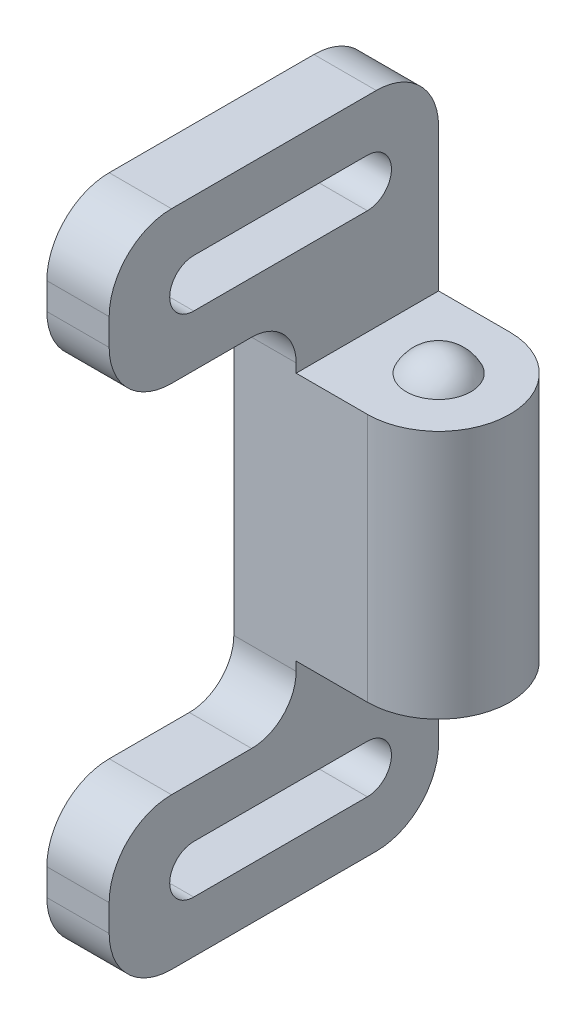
ISO-10303-21;
HEADER;
FILE_DESCRIPTION(('STEP AP214'),'2;1');
FILE_NAME('part.step','',(''),(''),'','','');
FILE_SCHEMA(('AUTOMOTIVE_DESIGN { 1 0 10303 214 1 1 1 1 }'));
ENDSEC;
DATA;
#1=APPLICATION_CONTEXT('core data for automotive mechanical design processes');
#2=APPLICATION_PROTOCOL_DEFINITION('international standard','automotive_design',2000,#1);
#3=PRODUCT_CONTEXT('',#1,'mechanical');
#4=PRODUCT('Part','Part','',(#3));
#5=PRODUCT_RELATED_PRODUCT_CATEGORY('part','',(#4));
#6=PRODUCT_DEFINITION_FORMATION('','',#4);
#7=PRODUCT_DEFINITION_CONTEXT('part definition',#1,'design');
#8=PRODUCT_DEFINITION('design','',#6,#7);
#9=PRODUCT_DEFINITION_SHAPE('','',#8);
#10=(LENGTH_UNIT() NAMED_UNIT(*) SI_UNIT(.MILLI.,.METRE.));
#11=(NAMED_UNIT(*) PLANE_ANGLE_UNIT() SI_UNIT($,.RADIAN.));
#12=(NAMED_UNIT(*) SI_UNIT($,.STERADIAN.) SOLID_ANGLE_UNIT());
#13=UNCERTAINTY_MEASURE_WITH_UNIT(LENGTH_MEASURE(1.E-05),#10,'distance_accuracy_value','');
#14=(GEOMETRIC_REPRESENTATION_CONTEXT(3) GLOBAL_UNCERTAINTY_ASSIGNED_CONTEXT((#13)) GLOBAL_UNIT_ASSIGNED_CONTEXT((#10,
#11,#12)) REPRESENTATION_CONTEXT('',''));
#15=CARTESIAN_POINT('',(0.,0.,0.));
#16=DIRECTION('',(0.,0.,1.));
#17=DIRECTION('',(1.,0.,0.));
#18=AXIS2_PLACEMENT_3D('',#15,#16,#17);
#19=CARTESIAN_POINT('',(15.,-12.3,0.));
#20=DIRECTION('',(1.,0.,0.));
#21=DIRECTION('',(0.,1.,0.));
#22=AXIS2_PLACEMENT_3D('',#19,#20,#21);
#23=SPHERICAL_SURFACE('',#22,3.99999999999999);
#24=CARTESIAN_POINT('',(18.6207733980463,-14.,0.));
#25=CARTESIAN_POINT('',(18.6207727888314,-14.,0.101659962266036));
#26=CARTESIAN_POINT('',(18.6164881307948,-14.,0.203338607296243));
#27=CARTESIAN_POINT('',(18.5993773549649,-14.,0.405993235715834));
#28=CARTESIAN_POINT('',(18.5865487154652,-14.,0.506969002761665));
#29=CARTESIAN_POINT('',(18.5524076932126,-14.,0.707650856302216));
#30=CARTESIAN_POINT('',(18.5310818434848,-14.,0.807354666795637));
#31=CARTESIAN_POINT('',(18.4800934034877,-14.,1.00466676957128));
#32=CARTESIAN_POINT('',(18.4504240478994,-14.,1.10227329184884));
#33=CARTESIAN_POINT('',(18.3493109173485,-14.,1.3904834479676));
#34=CARTESIAN_POINT('',(18.2656790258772,-14.,1.57696270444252));
#35=CARTESIAN_POINT('',(18.0682507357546,-14.,1.93321304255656));
#36=CARTESIAN_POINT('',(17.9544531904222,-14.,2.10298348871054));
#37=CARTESIAN_POINT('',(17.7637233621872,-14.,2.34141903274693));
#38=CARTESIAN_POINT('',(17.6967574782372,-14.,2.41823910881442));
#39=CARTESIAN_POINT('',(17.5566451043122,-14.,2.56591190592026));
#40=CARTESIAN_POINT('',(17.4835046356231,-14.,2.63677030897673));
#41=CARTESIAN_POINT('',(17.3314794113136,-14.,2.77210467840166));
#42=CARTESIAN_POINT('',(17.2525920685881,-14.,2.83657773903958));
#43=CARTESIAN_POINT('',(17.0896736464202,-14.,2.95865551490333));
#44=CARTESIAN_POINT('',(17.0056413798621,-14.,3.01625863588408));
#45=CARTESIAN_POINT('',(16.7467434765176,-14.,3.17808174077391));
#46=CARTESIAN_POINT('',(16.5649160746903,-14.,3.27145822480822));
#47=CARTESIAN_POINT('',(16.1882634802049,-14.,3.42630276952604));
#48=CARTESIAN_POINT('',(15.9934384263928,-14.,3.48777117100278));
#49=CARTESIAN_POINT('',(15.5962087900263,-14.,3.57714367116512));
#50=CARTESIAN_POINT('',(15.3938041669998,-14.,3.60504759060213));
#51=CARTESIAN_POINT('',(14.987183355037,-14.,3.62647012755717));
#52=CARTESIAN_POINT('',(14.7829671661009,-14.,3.61998874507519));
#53=CARTESIAN_POINT('',(14.3785455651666,-14.,3.57285068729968));
#54=CARTESIAN_POINT('',(14.1783401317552,-14.,3.53219419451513));
#55=CARTESIAN_POINT('',(13.7875020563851,-14.,3.41778436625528));
#56=CARTESIAN_POINT('',(13.5968695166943,-14.,3.34403067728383));
#57=CARTESIAN_POINT('',(13.322400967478,-14.,3.21030761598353));
#58=CARTESIAN_POINT('',(13.2327811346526,-14.,3.16185323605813));
#59=CARTESIAN_POINT('',(13.0579370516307,-14.,3.05757024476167));
#60=CARTESIAN_POINT('',(12.9727117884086,-14.,3.00174334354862));
#61=CARTESIAN_POINT('',(12.8073076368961,-14.,2.88313252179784));
#62=CARTESIAN_POINT('',(12.7271264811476,-14.,2.82035176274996));
#63=CARTESIAN_POINT('',(12.5722727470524,-14.,2.68821905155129));
#64=CARTESIAN_POINT('',(12.4976055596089,-14.,2.61886081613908));
#65=CARTESIAN_POINT('',(12.2828775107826,-14.,2.40178654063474));
#66=CARTESIAN_POINT('',(12.1518709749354,-14.,2.24491342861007));
#67=CARTESIAN_POINT('',(11.9181019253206,-14.,1.91138042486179));
#68=CARTESIAN_POINT('',(11.815338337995,-14.,1.7347212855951));
#69=CARTESIAN_POINT('',(11.6845007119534,-14.,1.45873129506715));
#70=CARTESIAN_POINT('',(11.6447394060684,-14.,1.36478267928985));
#71=CARTESIAN_POINT('',(11.5733002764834,-14.,1.17392058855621));
#72=CARTESIAN_POINT('',(11.5416159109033,-14.,1.07700958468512));
#73=CARTESIAN_POINT('',(11.4865768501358,-14.,0.881026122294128));
#74=CARTESIAN_POINT('',(11.4632090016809,-14.,0.781957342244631));
#75=CARTESIAN_POINT('',(11.4248986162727,-14.,0.582222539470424));
#76=CARTESIAN_POINT('',(11.4099535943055,-14.,0.481556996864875));
#77=CARTESIAN_POINT('',(11.3925947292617,-14.,0.317279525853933));
#78=CARTESIAN_POINT('',(11.3875832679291,-14.,0.253930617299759));
#79=CARTESIAN_POINT('',(11.3808990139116,-14.,0.127056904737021));
#80=CARTESIAN_POINT('',(11.3792262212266,-14.,0.0635321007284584));
#81=CARTESIAN_POINT('',(11.3792272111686,-14.,-0.101659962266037));
#82=CARTESIAN_POINT('',(11.3835118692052,-14.,-0.203338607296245));
#83=CARTESIAN_POINT('',(11.4006226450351,-14.,-0.405993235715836));
#84=CARTESIAN_POINT('',(11.4134512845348,-14.,-0.506969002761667));
#85=CARTESIAN_POINT('',(11.4475923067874,-14.,-0.707650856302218));
#86=CARTESIAN_POINT('',(11.4689181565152,-14.,-0.80735466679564));
#87=CARTESIAN_POINT('',(11.5199065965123,-14.,-1.00466676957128));
#88=CARTESIAN_POINT('',(11.5495759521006,-14.,-1.10227329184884));
#89=CARTESIAN_POINT('',(11.6506890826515,-14.,-1.3904834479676));
#90=CARTESIAN_POINT('',(11.7343209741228,-14.,-1.57696270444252));
#91=CARTESIAN_POINT('',(11.9317492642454,-14.,-1.93321304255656));
#92=CARTESIAN_POINT('',(12.0455468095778,-14.,-2.10298348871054));
#93=CARTESIAN_POINT('',(12.2362766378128,-14.,-2.34141903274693));
#94=CARTESIAN_POINT('',(12.3032425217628,-14.,-2.41823910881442));
#95=CARTESIAN_POINT('',(12.4433548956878,-14.,-2.56591190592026));
#96=CARTESIAN_POINT('',(12.5164953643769,-14.,-2.63677030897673));
#97=CARTESIAN_POINT('',(12.6685205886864,-14.,-2.77210467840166));
#98=CARTESIAN_POINT('',(12.7474079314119,-14.,-2.83657773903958));
#99=CARTESIAN_POINT('',(12.9103263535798,-14.,-2.95865551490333));
#100=CARTESIAN_POINT('',(12.9943586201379,-14.,-3.01625863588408));
#101=CARTESIAN_POINT('',(13.2532565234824,-14.,-3.17808174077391));
#102=CARTESIAN_POINT('',(13.4350839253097,-14.,-3.27145822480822));
#103=CARTESIAN_POINT('',(13.8117365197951,-14.,-3.42630276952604));
#104=CARTESIAN_POINT('',(14.0065615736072,-14.,-3.48777117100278));
#105=CARTESIAN_POINT('',(14.4037912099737,-14.,-3.57714367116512));
#106=CARTESIAN_POINT('',(14.6061958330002,-14.,-3.60504759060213));
#107=CARTESIAN_POINT('',(15.012816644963,-14.,-3.62647012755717));
#108=CARTESIAN_POINT('',(15.2170328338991,-14.,-3.61998874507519));
#109=CARTESIAN_POINT('',(15.6214544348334,-14.,-3.57285068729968));
#110=CARTESIAN_POINT('',(15.8216598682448,-14.,-3.53219419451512));
#111=CARTESIAN_POINT('',(16.2124979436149,-14.,-3.41778436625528));
#112=CARTESIAN_POINT('',(16.4031304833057,-14.,-3.34403067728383));
#113=CARTESIAN_POINT('',(16.677599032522,-14.,-3.21030761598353));
#114=CARTESIAN_POINT('',(16.7672188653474,-14.,-3.16185323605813));
#115=CARTESIAN_POINT('',(16.9420629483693,-14.,-3.05757024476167));
#116=CARTESIAN_POINT('',(17.0272882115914,-14.,-3.00174334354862));
#117=CARTESIAN_POINT('',(17.1926923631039,-14.,-2.88313252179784));
#118=CARTESIAN_POINT('',(17.2728735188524,-14.,-2.82035176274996));
#119=CARTESIAN_POINT('',(17.4277272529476,-14.,-2.68821905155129));
#120=CARTESIAN_POINT('',(17.5023944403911,-14.,-2.61886081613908));
#121=CARTESIAN_POINT('',(17.7171224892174,-14.,-2.40178654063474));
#122=CARTESIAN_POINT('',(17.8481290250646,-14.,-2.24491342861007));
#123=CARTESIAN_POINT('',(18.0818980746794,-14.,-1.91138042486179));
#124=CARTESIAN_POINT('',(18.184661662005,-14.,-1.7347212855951));
#125=CARTESIAN_POINT('',(18.3154992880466,-14.,-1.45873129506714));
#126=CARTESIAN_POINT('',(18.3552605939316,-14.,-1.36478267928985));
#127=CARTESIAN_POINT('',(18.4266997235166,-14.,-1.17392058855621));
#128=CARTESIAN_POINT('',(18.4583840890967,-14.,-1.07700958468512));
#129=CARTESIAN_POINT('',(18.5134231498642,-14.,-0.881026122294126));
#130=CARTESIAN_POINT('',(18.5367909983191,-14.,-0.781957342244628));
#131=CARTESIAN_POINT('',(18.5751013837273,-14.,-0.582222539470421));
#132=CARTESIAN_POINT('',(18.5900464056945,-14.,-0.481556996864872));
#133=CARTESIAN_POINT('',(18.6074052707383,-14.,-0.317279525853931));
#134=CARTESIAN_POINT('',(18.6124167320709,-14.,-0.253930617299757));
#135=CARTESIAN_POINT('',(18.6191009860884,-14.,-0.127056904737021));
#136=CARTESIAN_POINT('',(18.6207737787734,-14.,-0.0635321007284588));
#137=CARTESIAN_POINT('',(18.6207733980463,-14.,0.));
#138=B_SPLINE_CURVE_WITH_KNOTS('',3,(#24,#25,#26,#27,#28,#29,#30,#31,#32,#33,#34,#35,#36,#37,
#38,#39,#40,#41,#42,#43,#44,#45,#46,#47,#48,#49,#50,#51,#52,#53,#54,#55,#56,#57,#58,#59,#60,#61,
#62,#63,#64,#65,#66,#67,#68,#69,#70,#71,#72,#73,#74,#75,#76,#77,#78,#79,#80,#81,#82,#83,#84,#85,
#86,#87,#88,#89,#90,#91,#92,#93,#94,#95,#96,#97,#98,#99,#100,#101,#102,#103,#104,#105,#106,#107,
#108,#109,#110,#111,#112,#113,#114,#115,#116,#117,#118,#119,#120,#121,#122,#123,#124,#125,#126,
#127,#128,#129,#130,#131,#132,#133,#134,#135,#136,#137),.UNSPECIFIED.,.T.,.F.,(4,2,2,2,2,2,2,2,
2,2,2,2,2,2,2,2,2,2,2,2,2,2,2,2,2,2,2,2,2,2,2,2,2,2,2,2,2,2,2,2,2,2,2,2,2,2,2,2,2,2,2,2,2,2,2,2,
4),(0.,0.30492139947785,0.609932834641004,0.915429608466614,1.22117481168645,1.83120776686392,
2.44126391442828,2.74669168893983,3.0518249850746,3.35709650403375,3.66243872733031,
4.27248653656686,4.88252783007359,5.49257238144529,6.10261693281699,6.71265822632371,
7.32270603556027,7.62804825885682,7.93331977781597,8.23845307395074,8.54388084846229,
9.15393699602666,9.76396995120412,10.069715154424,10.3752119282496,10.6802233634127,
10.9851447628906,11.1757045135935,11.3662642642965,11.6711856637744,11.9761970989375,
12.2816938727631,12.587439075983,13.1974720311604,13.8075281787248,14.1129559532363,
14.4180892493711,14.7233607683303,15.0287029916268,15.6387508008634,16.2487920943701,
16.8588366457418,17.4688811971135,18.0789224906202,18.6889702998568,18.9943125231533,
19.2995840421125,19.6047173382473,19.9101451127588,20.5202012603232,21.1302342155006,
21.4359794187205,21.7414761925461,22.0464876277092,22.3514090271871,22.5419687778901,
22.732528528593),.UNSPECIFIED.);
#139=CARTESIAN_POINT('',(18.6207733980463,-14.,0.));
#140=VERTEX_POINT('',#139);
#141=EDGE_CURVE('E21',#140,#140,#138,.T.);
#142=ORIENTED_EDGE('',*,*,#141,.T.);
#143=EDGE_LOOP('',(#142));
#144=FACE_BOUND('',#143,.T.);
#145=ADVANCED_FACE('F16',(#144),#23,.T.);
#146=CARTESIAN_POINT('',(15.,12.3,0.));
#147=DIRECTION('',(1.,0.,0.));
#148=DIRECTION('',(0.,1.,0.));
#149=AXIS2_PLACEMENT_3D('',#146,#147,#148);
#150=SPHERICAL_SURFACE('',#149,3.99999999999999);
#151=CARTESIAN_POINT('',(18.6207733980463,14.,0.));
#152=CARTESIAN_POINT('',(18.6207727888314,14.,0.101659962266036));
#153=CARTESIAN_POINT('',(18.6164881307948,14.,0.203338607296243));
#154=CARTESIAN_POINT('',(18.5993773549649,14.,0.405993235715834));
#155=CARTESIAN_POINT('',(18.5865487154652,14.,0.506969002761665));
#156=CARTESIAN_POINT('',(18.5524076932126,14.,0.707650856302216));
#157=CARTESIAN_POINT('',(18.5310818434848,14.,0.807354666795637));
#158=CARTESIAN_POINT('',(18.4800934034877,14.,1.00466676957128));
#159=CARTESIAN_POINT('',(18.4504240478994,14.,1.10227329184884));
#160=CARTESIAN_POINT('',(18.3493109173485,14.,1.3904834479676));
#161=CARTESIAN_POINT('',(18.2656790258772,14.,1.57696270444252));
#162=CARTESIAN_POINT('',(18.0682507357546,14.,1.93321304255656));
#163=CARTESIAN_POINT('',(17.9544531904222,14.,2.10298348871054));
#164=CARTESIAN_POINT('',(17.7637233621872,14.,2.34141903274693));
#165=CARTESIAN_POINT('',(17.6967574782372,14.,2.41823910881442));
#166=CARTESIAN_POINT('',(17.5566451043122,14.,2.56591190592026));
#167=CARTESIAN_POINT('',(17.4835046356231,14.,2.63677030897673));
#168=CARTESIAN_POINT('',(17.3314794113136,14.,2.77210467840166));
#169=CARTESIAN_POINT('',(17.2525920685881,14.,2.83657773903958));
#170=CARTESIAN_POINT('',(17.0896736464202,14.,2.95865551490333));
#171=CARTESIAN_POINT('',(17.0056413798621,14.,3.01625863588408));
#172=CARTESIAN_POINT('',(16.7467434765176,14.,3.17808174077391));
#173=CARTESIAN_POINT('',(16.5649160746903,14.,3.27145822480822));
#174=CARTESIAN_POINT('',(16.1882634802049,14.,3.42630276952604));
#175=CARTESIAN_POINT('',(15.9934384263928,14.,3.48777117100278));
#176=CARTESIAN_POINT('',(15.5962087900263,14.,3.57714367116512));
#177=CARTESIAN_POINT('',(15.3938041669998,14.,3.60504759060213));
#178=CARTESIAN_POINT('',(14.987183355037,14.,3.62647012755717));
#179=CARTESIAN_POINT('',(14.7829671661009,14.,3.61998874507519));
#180=CARTESIAN_POINT('',(14.3785455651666,14.,3.57285068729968));
#181=CARTESIAN_POINT('',(14.1783401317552,14.,3.53219419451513));
#182=CARTESIAN_POINT('',(13.7875020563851,14.,3.41778436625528));
#183=CARTESIAN_POINT('',(13.5968695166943,14.,3.34403067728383));
#184=CARTESIAN_POINT('',(13.322400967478,14.,3.21030761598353));
#185=CARTESIAN_POINT('',(13.2327811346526,14.,3.16185323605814));
#186=CARTESIAN_POINT('',(13.0579370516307,14.,3.05757024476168));
#187=CARTESIAN_POINT('',(12.9727117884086,14.,3.00174334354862));
#188=CARTESIAN_POINT('',(12.8073076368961,14.,2.88313252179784));
#189=CARTESIAN_POINT('',(12.7271264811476,14.,2.82035176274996));
#190=CARTESIAN_POINT('',(12.5722727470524,14.,2.68821905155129));
#191=CARTESIAN_POINT('',(12.4976055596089,14.,2.61886081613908));
#192=CARTESIAN_POINT('',(12.2828775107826,14.,2.40178654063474));
#193=CARTESIAN_POINT('',(12.1518709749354,14.,2.24491342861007));
#194=CARTESIAN_POINT('',(11.9181019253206,14.,1.91138042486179));
#195=CARTESIAN_POINT('',(11.815338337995,14.,1.7347212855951));
#196=CARTESIAN_POINT('',(11.6845007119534,14.,1.45873129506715));
#197=CARTESIAN_POINT('',(11.6447394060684,14.,1.36478267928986));
#198=CARTESIAN_POINT('',(11.5733002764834,14.,1.17392058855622));
#199=CARTESIAN_POINT('',(11.5416159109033,14.,1.07700958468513));
#200=CARTESIAN_POINT('',(11.4865768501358,14.,0.881026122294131));
#201=CARTESIAN_POINT('',(11.4632090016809,14.,0.781957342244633));
#202=CARTESIAN_POINT('',(11.4248986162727,14.,0.582222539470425));
#203=CARTESIAN_POINT('',(11.4099535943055,14.,0.481556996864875));
#204=CARTESIAN_POINT('',(11.3925947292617,14.,0.317279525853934));
#205=CARTESIAN_POINT('',(11.3875832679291,14.,0.253930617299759));
#206=CARTESIAN_POINT('',(11.3808990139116,14.,0.127056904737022));
#207=CARTESIAN_POINT('',(11.3792262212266,14.,0.0635321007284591));
#208=CARTESIAN_POINT('',(11.3792272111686,14.,-0.101659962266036));
#209=CARTESIAN_POINT('',(11.3835118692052,14.,-0.203338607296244));
#210=CARTESIAN_POINT('',(11.4006226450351,14.,-0.405993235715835));
#211=CARTESIAN_POINT('',(11.4134512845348,14.,-0.506969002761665));
#212=CARTESIAN_POINT('',(11.4475923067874,14.,-0.707650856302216));
#213=CARTESIAN_POINT('',(11.4689181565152,14.,-0.807354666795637));
#214=CARTESIAN_POINT('',(11.5199065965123,14.,-1.00466676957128));
#215=CARTESIAN_POINT('',(11.5495759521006,14.,-1.10227329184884));
#216=CARTESIAN_POINT('',(11.6506890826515,14.,-1.3904834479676));
#217=CARTESIAN_POINT('',(11.7343209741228,14.,-1.57696270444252));
#218=CARTESIAN_POINT('',(11.9317492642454,14.,-1.93321304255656));
#219=CARTESIAN_POINT('',(12.0455468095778,14.,-2.10298348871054));
#220=CARTESIAN_POINT('',(12.2362766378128,14.,-2.34141903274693));
#221=CARTESIAN_POINT('',(12.3032425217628,14.,-2.41823910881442));
#222=CARTESIAN_POINT('',(12.4433548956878,14.,-2.56591190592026));
#223=CARTESIAN_POINT('',(12.5164953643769,14.,-2.63677030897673));
#224=CARTESIAN_POINT('',(12.6685205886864,14.,-2.77210467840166));
#225=CARTESIAN_POINT('',(12.7474079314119,14.,-2.83657773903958));
#226=CARTESIAN_POINT('',(12.9103263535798,14.,-2.95865551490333));
#227=CARTESIAN_POINT('',(12.9943586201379,14.,-3.01625863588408));
#228=CARTESIAN_POINT('',(13.2532565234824,14.,-3.17808174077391));
#229=CARTESIAN_POINT('',(13.4350839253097,14.,-3.27145822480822));
#230=CARTESIAN_POINT('',(13.8117365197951,14.,-3.42630276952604));
#231=CARTESIAN_POINT('',(14.0065615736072,14.,-3.48777117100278));
#232=CARTESIAN_POINT('',(14.4037912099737,14.,-3.57714367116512));
#233=CARTESIAN_POINT('',(14.6061958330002,14.,-3.60504759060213));
#234=CARTESIAN_POINT('',(15.012816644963,14.,-3.62647012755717));
#235=CARTESIAN_POINT('',(15.2170328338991,14.,-3.61998874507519));
#236=CARTESIAN_POINT('',(15.6214544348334,14.,-3.57285068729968));
#237=CARTESIAN_POINT('',(15.8216598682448,14.,-3.53219419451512));
#238=CARTESIAN_POINT('',(16.2124979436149,14.,-3.41778436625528));
#239=CARTESIAN_POINT('',(16.4031304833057,14.,-3.34403067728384));
#240=CARTESIAN_POINT('',(16.677599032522,14.,-3.21030761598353));
#241=CARTESIAN_POINT('',(16.7672188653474,14.,-3.16185323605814));
#242=CARTESIAN_POINT('',(16.9420629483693,14.,-3.05757024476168));
#243=CARTESIAN_POINT('',(17.0272882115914,14.,-3.00174334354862));
#244=CARTESIAN_POINT('',(17.1926923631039,14.,-2.88313252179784));
#245=CARTESIAN_POINT('',(17.2728735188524,14.,-2.82035176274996));
#246=CARTESIAN_POINT('',(17.4277272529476,14.,-2.6882190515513));
#247=CARTESIAN_POINT('',(17.5023944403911,14.,-2.61886081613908));
#248=CARTESIAN_POINT('',(17.7171224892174,14.,-2.40178654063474));
#249=CARTESIAN_POINT('',(17.8481290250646,14.,-2.24491342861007));
#250=CARTESIAN_POINT('',(18.0818980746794,14.,-1.91138042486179));
#251=CARTESIAN_POINT('',(18.184661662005,14.,-1.7347212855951));
#252=CARTESIAN_POINT('',(18.3154992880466,14.,-1.45873129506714));
#253=CARTESIAN_POINT('',(18.3552605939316,14.,-1.36478267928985));
#254=CARTESIAN_POINT('',(18.4266997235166,14.,-1.17392058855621));
#255=CARTESIAN_POINT('',(18.4583840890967,14.,-1.07700958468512));
#256=CARTESIAN_POINT('',(18.5134231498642,14.,-0.881026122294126));
#257=CARTESIAN_POINT('',(18.5367909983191,14.,-0.781957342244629));
#258=CARTESIAN_POINT('',(18.5751013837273,14.,-0.582222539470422));
#259=CARTESIAN_POINT('',(18.5900464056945,14.,-0.481556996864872));
#260=CARTESIAN_POINT('',(18.6074052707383,14.,-0.317279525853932));
#261=CARTESIAN_POINT('',(18.6124167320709,14.,-0.253930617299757));
#262=CARTESIAN_POINT('',(18.6191009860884,14.,-0.127056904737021));
#263=CARTESIAN_POINT('',(18.6207737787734,14.,-0.0635321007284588));
#264=CARTESIAN_POINT('',(18.6207733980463,14.,0.));
#265=B_SPLINE_CURVE_WITH_KNOTS('',3,(#151,#152,#153,#154,#155,#156,#157,#158,#159,#160,#161,
#162,#163,#164,#165,#166,#167,#168,#169,#170,#171,#172,#173,#174,#175,#176,#177,#178,#179,#180,
#181,#182,#183,#184,#185,#186,#187,#188,#189,#190,#191,#192,#193,#194,#195,#196,#197,#198,#199,
#200,#201,#202,#203,#204,#205,#206,#207,#208,#209,#210,#211,#212,#213,#214,#215,#216,#217,#218,
#219,#220,#221,#222,#223,#224,#225,#226,#227,#228,#229,#230,#231,#232,#233,#234,#235,#236,#237,
#238,#239,#240,#241,#242,#243,#244,#245,#246,#247,#248,#249,#250,#251,#252,#253,#254,#255,#256,
#257,#258,#259,#260,#261,#262,#263,#264),.UNSPECIFIED.,.T.,.F.,(4,2,2,2,2,2,2,2,2,2,2,2,2,2,2,2,
2,2,2,2,2,2,2,2,2,2,2,2,2,2,2,2,2,2,2,2,2,2,2,2,2,2,2,2,2,2,2,2,2,2,2,2,2,2,2,2,4),(0.,
0.30492139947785,0.609932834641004,0.915429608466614,1.22117481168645,1.83120776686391,
2.44126391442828,2.74669168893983,3.0518249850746,3.35709650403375,3.66243872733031,
4.27248653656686,4.88252783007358,5.49257238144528,6.10261693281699,6.71265822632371,
7.32270603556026,7.62804825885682,7.93331977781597,8.23845307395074,8.54388084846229,
9.15393699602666,9.76396995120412,10.069715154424,10.3752119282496,10.6802233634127,
10.9851447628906,11.1757045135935,11.3662642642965,11.6711856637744,11.9761970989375,
12.2816938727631,12.587439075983,13.1974720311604,13.8075281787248,14.1129559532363,
14.4180892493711,14.7233607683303,15.0287029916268,15.6387508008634,16.2487920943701,
16.8588366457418,17.4688811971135,18.0789224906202,18.6889702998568,18.9943125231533,
19.2995840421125,19.6047173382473,19.9101451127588,20.5202012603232,21.1302342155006,
21.4359794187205,21.7414761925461,22.0464876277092,22.3514090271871,22.5419687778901,
22.732528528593),.UNSPECIFIED.);
#266=CARTESIAN_POINT('',(18.6207733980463,14.,0.));
#267=VERTEX_POINT('',#266);
#268=EDGE_CURVE('E263',#267,#267,#265,.T.);
#269=ORIENTED_EDGE('',*,*,#268,.F.);
#270=EDGE_LOOP('',(#269));
#271=FACE_BOUND('',#270,.T.);
#272=ADVANCED_FACE('F362',(#271),#150,.T.);
#273=CARTESIAN_POINT('',(0.,-14.,0.));
#274=DIRECTION('',(0.,1.,0.));
#275=DIRECTION('',(0.,0.,1.));
#276=AXIS2_PLACEMENT_3D('',#273,#274,#275);
#277=PLANE('',#276);
#278=ORIENTED_EDGE('',*,*,#141,.F.);
#279=EDGE_LOOP('',(#278));
#280=FACE_BOUND('',#279,.T.);
#281=DIRECTION('',(-1.,0.,0.));
#282=VECTOR('',#281,1.);
#283=CARTESIAN_POINT('',(0.,-14.,-8.));
#284=LINE('',#283,#282);
#285=CARTESIAN_POINT('',(15.,-14.,-8.));
#286=VERTEX_POINT('',#285);
#287=CARTESIAN_POINT('',(7.,-14.,-8.));
#288=VERTEX_POINT('',#287);
#289=EDGE_CURVE('E330',#286,#288,#284,.T.);
#290=ORIENTED_EDGE('',*,*,#289,.F.);
#291=CARTESIAN_POINT('',(15.,-14.,0.));
#292=DIRECTION('',(0.,1.,0.));
#293=DIRECTION('',(0.,0.,1.));
#294=AXIS2_PLACEMENT_3D('',#291,#292,#293);
#295=CIRCLE('',#294,8.);
#296=CARTESIAN_POINT('',(15.,-14.,8.));
#297=VERTEX_POINT('',#296);
#298=EDGE_CURVE('E741',#297,#286,#295,.T.);
#299=ORIENTED_EDGE('',*,*,#298,.F.);
#300=DIRECTION('',(1.,0.,0.));
#301=VECTOR('',#300,1.);
#302=CARTESIAN_POINT('',(0.,-14.,8.));
#303=LINE('',#302,#301);
#304=CARTESIAN_POINT('',(7.,-14.,8.));
#305=VERTEX_POINT('',#304);
#306=EDGE_CURVE('E233',#305,#297,#303,.T.);
#307=ORIENTED_EDGE('',*,*,#306,.F.);
#308=DIRECTION('',(0.,0.,-1.));
#309=VECTOR('',#308,1.);
#310=CARTESIAN_POINT('',(7.,-14.,0.));
#311=LINE('',#310,#309);
#312=EDGE_CURVE('E242',#288,#305,#311,.F.);
#313=ORIENTED_EDGE('',*,*,#312,.F.);
#314=EDGE_LOOP('',(#290,#299,#307,#313));
#315=FACE_BOUND('',#314,.T.);
#316=ADVANCED_FACE('F365',(#280,#315),#277,.F.);
#317=CARTESIAN_POINT('',(15.,14.,0.));
#318=DIRECTION('',(0.,1.,0.));
#319=DIRECTION('',(0.,0.,1.));
#320=AXIS2_PLACEMENT_3D('',#317,#318,#319);
#321=CYLINDRICAL_SURFACE('',#320,8.);
#322=CARTESIAN_POINT('',(15.,14.,0.));
#323=DIRECTION('',(0.,1.,0.));
#324=DIRECTION('',(0.,0.,1.));
#325=AXIS2_PLACEMENT_3D('',#322,#323,#324);
#326=CIRCLE('',#325,8.);
#327=CARTESIAN_POINT('',(15.,14.,8.));
#328=VERTEX_POINT('',#327);
#329=CARTESIAN_POINT('',(15.,14.,-8.));
#330=VERTEX_POINT('',#329);
#331=EDGE_CURVE('E376',#328,#330,#326,.T.);
#332=ORIENTED_EDGE('',*,*,#331,.F.);
#333=DIRECTION('',(0.,1.,0.));
#334=VECTOR('',#333,1.);
#335=CARTESIAN_POINT('',(15.,-15.,8.));
#336=LINE('',#335,#334);
#337=EDGE_CURVE('E269',#297,#328,#336,.T.);
#338=ORIENTED_EDGE('',*,*,#337,.F.);
#339=ORIENTED_EDGE('',*,*,#298,.T.);
#340=DIRECTION('',(0.,1.,0.));
#341=VECTOR('',#340,1.);
#342=CARTESIAN_POINT('',(15.,30.,-8.));
#343=LINE('',#342,#341);
#344=EDGE_CURVE('E326',#330,#286,#343,.F.);
#345=ORIENTED_EDGE('',*,*,#344,.F.);
#346=EDGE_LOOP('',(#332,#338,#339,#345));
#347=FACE_BOUND('',#346,.T.);
#348=ADVANCED_FACE('F381',(#347),#321,.T.);
#349=CARTESIAN_POINT('',(0.,14.,0.));
#350=DIRECTION('',(0.,1.,0.));
#351=DIRECTION('',(0.,0.,1.));
#352=AXIS2_PLACEMENT_3D('',#349,#350,#351);
#353=PLANE('',#352);
#354=ORIENTED_EDGE('',*,*,#268,.T.);
#355=EDGE_LOOP('',(#354));
#356=FACE_BOUND('',#355,.T.);
#357=ORIENTED_EDGE('',*,*,#331,.T.);
#358=DIRECTION('',(-1.,0.,0.));
#359=VECTOR('',#358,1.);
#360=CARTESIAN_POINT('',(0.,14.,-8.));
#361=LINE('',#360,#359);
#362=CARTESIAN_POINT('',(7.,14.,-8.));
#363=VERTEX_POINT('',#362);
#364=EDGE_CURVE('E257',#363,#330,#361,.F.);
#365=ORIENTED_EDGE('',*,*,#364,.F.);
#366=DIRECTION('',(0.,0.,-1.));
#367=VECTOR('',#366,1.);
#368=CARTESIAN_POINT('',(7.,14.,0.));
#369=LINE('',#368,#367);
#370=CARTESIAN_POINT('',(7.,14.,8.));
#371=VERTEX_POINT('',#370);
#372=EDGE_CURVE('E252',#371,#363,#369,.T.);
#373=ORIENTED_EDGE('',*,*,#372,.F.);
#374=DIRECTION('',(1.,0.,0.));
#375=VECTOR('',#374,1.);
#376=CARTESIAN_POINT('',(0.,14.,8.));
#377=LINE('',#376,#375);
#378=EDGE_CURVE('E255',#328,#371,#377,.F.);
#379=ORIENTED_EDGE('',*,*,#378,.F.);
#380=EDGE_LOOP('',(#357,#365,#373,#379));
#381=FACE_BOUND('',#380,.T.);
#382=ADVANCED_FACE('F254',(#356,#381),#353,.T.);
#383=CARTESIAN_POINT('',(7.,0.,0.));
#384=DIRECTION('',(1.,0.,0.));
#385=DIRECTION('',(0.,0.,-1.));
#386=AXIS2_PLACEMENT_3D('',#383,#384,#385);
#387=PLANE('',#386);
#388=CARTESIAN_POINT('',(7.,28.5,0.));
#389=DIRECTION('',(-1.,0.,0.));
#390=DIRECTION('',(0.,0.,1.));
#391=AXIS2_PLACEMENT_3D('',#388,#389,#390);
#392=CIRCLE('',#391,2.7);
#393=CARTESIAN_POINT('',(7.,31.2,0.));
#394=VERTEX_POINT('',#393);
#395=CARTESIAN_POINT('',(7.,25.8,0.));
#396=VERTEX_POINT('',#395);
#397=EDGE_CURVE('E271',#394,#396,#392,.T.);
#398=ORIENTED_EDGE('',*,*,#397,.T.);
#399=DIRECTION('',(0.,0.,1.));
#400=VECTOR('',#399,1.);
#401=CARTESIAN_POINT('',(7.,25.8,19.5));
#402=LINE('',#401,#400);
#403=CARTESIAN_POINT('',(7.,25.8,19.5));
#404=VERTEX_POINT('',#403);
#405=EDGE_CURVE('E548',#404,#396,#402,.F.);
#406=ORIENTED_EDGE('',*,*,#405,.F.);
#407=CARTESIAN_POINT('',(7.,28.5,19.5));
#408=DIRECTION('',(-1.,0.,0.));
#409=DIRECTION('',(0.,0.,1.));
#410=AXIS2_PLACEMENT_3D('',#407,#408,#409);
#411=CIRCLE('',#410,2.7);
#412=CARTESIAN_POINT('',(7.,31.2,19.5));
#413=VERTEX_POINT('',#412);
#414=EDGE_CURVE('E547',#404,#413,#411,.T.);
#415=ORIENTED_EDGE('',*,*,#414,.T.);
#416=DIRECTION('',(0.,0.,-1.));
#417=VECTOR('',#416,1.);
#418=CARTESIAN_POINT('',(7.,31.2,0.));
#419=LINE('',#418,#417);
#420=EDGE_CURVE('E543',#394,#413,#419,.F.);
#421=ORIENTED_EDGE('',*,*,#420,.F.);
#422=EDGE_LOOP('',(#398,#406,#415,#421));
#423=FACE_BOUND('',#422,.T.);
#424=CARTESIAN_POINT('',(7.,15.,13.));
#425=DIRECTION('',(-1.,0.,0.));
#426=DIRECTION('',(0.,0.,1.));
#427=AXIS2_PLACEMENT_3D('',#424,#425,#426);
#428=CIRCLE('',#427,5.);
#429=CARTESIAN_POINT('',(7.,20.,13.));
#430=VERTEX_POINT('',#429);
#431=CARTESIAN_POINT('',(7.,15.,8.));
#432=VERTEX_POINT('',#431);
#433=EDGE_CURVE('E275',#430,#432,#428,.T.);
#434=ORIENTED_EDGE('',*,*,#433,.T.);
#435=DIRECTION('',(0.,1.,0.));
#436=VECTOR('',#435,1.);
#437=CARTESIAN_POINT('',(7.,-15.,8.));
#438=LINE('',#437,#436);
#439=EDGE_CURVE('E266',#371,#432,#438,.T.);
#440=ORIENTED_EDGE('',*,*,#439,.F.);
#441=ORIENTED_EDGE('',*,*,#372,.T.);
#442=DIRECTION('',(0.,1.,0.));
#443=VECTOR('',#442,1.);
#444=CARTESIAN_POINT('',(7.,30.,-8.));
#445=LINE('',#444,#443);
#446=CARTESIAN_POINT('',(7.,30.,-8.));
#447=VERTEX_POINT('',#446);
#448=EDGE_CURVE('E320',#447,#363,#445,.F.);
#449=ORIENTED_EDGE('',*,*,#448,.F.);
#450=CARTESIAN_POINT('',(7.,30.,-0.999999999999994));
#451=DIRECTION('',(-1.,0.,0.));
#452=DIRECTION('',(0.,0.,1.));
#453=AXIS2_PLACEMENT_3D('',#450,#451,#452);
#454=CIRCLE('',#453,7.00000000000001);
#455=CARTESIAN_POINT('',(7.,37.,-0.999999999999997));
#456=VERTEX_POINT('',#455);
#457=EDGE_CURVE('E334',#456,#447,#454,.T.);
#458=ORIENTED_EDGE('',*,*,#457,.F.);
#459=DIRECTION('',(0.,0.,1.));
#460=VECTOR('',#459,1.);
#461=CARTESIAN_POINT('',(7.,37.,22.));
#462=LINE('',#461,#460);
#463=CARTESIAN_POINT('',(7.,37.,22.));
#464=VERTEX_POINT('',#463);
#465=EDGE_CURVE('E315',#464,#456,#462,.F.);
#466=ORIENTED_EDGE('',*,*,#465,.F.);
#467=CARTESIAN_POINT('',(7.,30.,22.));
#468=DIRECTION('',(-1.,0.,0.));
#469=DIRECTION('',(0.,0.,1.));
#470=AXIS2_PLACEMENT_3D('',#467,#468,#469);
#471=CIRCLE('',#470,7.00000000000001);
#472=CARTESIAN_POINT('',(7.,30.,29.));
#473=VERTEX_POINT('',#472);
#474=EDGE_CURVE('E599',#473,#464,#471,.T.);
#475=ORIENTED_EDGE('',*,*,#474,.F.);
#476=DIRECTION('',(0.,1.,0.));
#477=VECTOR('',#476,1.);
#478=CARTESIAN_POINT('',(7.,27.,29.));
#479=LINE('',#478,#477);
#480=CARTESIAN_POINT('',(7.,27.,29.));
#481=VERTEX_POINT('',#480);
#482=EDGE_CURVE('E310',#481,#473,#479,.T.);
#483=ORIENTED_EDGE('',*,*,#482,.F.);
#484=CARTESIAN_POINT('',(7.,27.,22.));
#485=DIRECTION('',(-1.,0.,0.));
#486=DIRECTION('',(0.,0.,1.));
#487=AXIS2_PLACEMENT_3D('',#484,#485,#486);
#488=CIRCLE('',#487,7.00000000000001);
#489=CARTESIAN_POINT('',(7.,20.,22.));
#490=VERTEX_POINT('',#489);
#491=EDGE_CURVE('E596',#490,#481,#488,.T.);
#492=ORIENTED_EDGE('',*,*,#491,.F.);
#493=DIRECTION('',(0.,0.,-1.));
#494=VECTOR('',#493,1.);
#495=CARTESIAN_POINT('',(7.,20.,13.));
#496=LINE('',#495,#494);
#497=EDGE_CURVE('E305',#430,#490,#496,.F.);
#498=ORIENTED_EDGE('',*,*,#497,.F.);
#499=EDGE_LOOP('',(#434,#440,#441,#449,#458,#466,#475,#483,#492,#498));
#500=FACE_BOUND('',#499,.T.);
#501=ADVANCED_FACE('F273',(#423,#500),#387,.T.);
#502=CARTESIAN_POINT('',(7.,0.,0.));
#503=DIRECTION('',(1.,0.,0.));
#504=DIRECTION('',(0.,0.,-1.));
#505=AXIS2_PLACEMENT_3D('',#502,#503,#504);
#506=PLANE('',#505);
#507=CARTESIAN_POINT('',(7.,-28.5,0.));
#508=DIRECTION('',(-1.,0.,0.));
#509=DIRECTION('',(0.,0.,1.));
#510=AXIS2_PLACEMENT_3D('',#507,#508,#509);
#511=CIRCLE('',#510,2.7);
#512=CARTESIAN_POINT('',(7.,-25.8,0.));
#513=VERTEX_POINT('',#512);
#514=CARTESIAN_POINT('',(7.,-31.2,0.));
#515=VERTEX_POINT('',#514);
#516=EDGE_CURVE('E499',#513,#515,#511,.T.);
#517=ORIENTED_EDGE('',*,*,#516,.T.);
#518=DIRECTION('',(0.,0.,1.));
#519=VECTOR('',#518,1.);
#520=CARTESIAN_POINT('',(7.,-31.2,19.5));
#521=LINE('',#520,#519);
#522=CARTESIAN_POINT('',(7.,-31.2,19.5));
#523=VERTEX_POINT('',#522);
#524=EDGE_CURVE('E539',#523,#515,#521,.F.);
#525=ORIENTED_EDGE('',*,*,#524,.F.);
#526=CARTESIAN_POINT('',(7.,-28.5,19.5));
#527=DIRECTION('',(-1.,0.,0.));
#528=DIRECTION('',(0.,0.,1.));
#529=AXIS2_PLACEMENT_3D('',#526,#527,#528);
#530=CIRCLE('',#529,2.7);
#531=CARTESIAN_POINT('',(7.,-25.8,19.5));
#532=VERTEX_POINT('',#531);
#533=EDGE_CURVE('E538',#523,#532,#530,.T.);
#534=ORIENTED_EDGE('',*,*,#533,.T.);
#535=DIRECTION('',(0.,0.,-1.));
#536=VECTOR('',#535,1.);
#537=CARTESIAN_POINT('',(7.,-25.8,0.));
#538=LINE('',#537,#536);
#539=EDGE_CURVE('E536',#513,#532,#538,.F.);
#540=ORIENTED_EDGE('',*,*,#539,.F.);
#541=EDGE_LOOP('',(#517,#525,#534,#540));
#542=FACE_BOUND('',#541,.T.);
#543=CARTESIAN_POINT('',(7.,-30.,-0.999999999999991));
#544=DIRECTION('',(-1.,0.,0.));
#545=DIRECTION('',(0.,0.,1.));
#546=AXIS2_PLACEMENT_3D('',#543,#544,#545);
#547=CIRCLE('',#546,7.);
#548=CARTESIAN_POINT('',(7.,-30.,-8.));
#549=VERTEX_POINT('',#548);
#550=CARTESIAN_POINT('',(7.,-37.,-0.999999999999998));
#551=VERTEX_POINT('',#550);
#552=EDGE_CURVE('E503',#549,#551,#547,.T.);
#553=ORIENTED_EDGE('',*,*,#552,.F.);
#554=DIRECTION('',(0.,1.,0.));
#555=VECTOR('',#554,1.);
#556=CARTESIAN_POINT('',(7.,30.,-8.));
#557=LINE('',#556,#555);
#558=EDGE_CURVE('E337',#288,#549,#557,.F.);
#559=ORIENTED_EDGE('',*,*,#558,.F.);
#560=ORIENTED_EDGE('',*,*,#312,.T.);
#561=DIRECTION('',(0.,1.,0.));
#562=VECTOR('',#561,1.);
#563=CARTESIAN_POINT('',(7.,-15.,8.));
#564=LINE('',#563,#562);
#565=CARTESIAN_POINT('',(7.,-15.,8.));
#566=VERTEX_POINT('',#565);
#567=EDGE_CURVE('E291',#566,#305,#564,.T.);
#568=ORIENTED_EDGE('',*,*,#567,.F.);
#569=CARTESIAN_POINT('',(7.,-15.,13.));
#570=DIRECTION('',(-1.,0.,0.));
#571=DIRECTION('',(0.,0.,1.));
#572=AXIS2_PLACEMENT_3D('',#569,#570,#571);
#573=CIRCLE('',#572,5.);
#574=CARTESIAN_POINT('',(7.,-20.,13.));
#575=VERTEX_POINT('',#574);
#576=EDGE_CURVE('E300',#566,#575,#573,.T.);
#577=ORIENTED_EDGE('',*,*,#576,.T.);
#578=DIRECTION('',(0.,0.,1.));
#579=VECTOR('',#578,1.);
#580=CARTESIAN_POINT('',(7.,-20.,22.));
#581=LINE('',#580,#579);
#582=CARTESIAN_POINT('',(7.,-20.,22.));
#583=VERTEX_POINT('',#582);
#584=EDGE_CURVE('E356',#583,#575,#581,.F.);
#585=ORIENTED_EDGE('',*,*,#584,.F.);
#586=CARTESIAN_POINT('',(7.,-27.,22.));
#587=DIRECTION('',(-1.,0.,0.));
#588=DIRECTION('',(0.,0.,1.));
#589=AXIS2_PLACEMENT_3D('',#586,#587,#588);
#590=CIRCLE('',#589,7.00000000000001);
#591=CARTESIAN_POINT('',(7.,-27.,29.));
#592=VERTEX_POINT('',#591);
#593=EDGE_CURVE('E533',#592,#583,#590,.T.);
#594=ORIENTED_EDGE('',*,*,#593,.F.);
#595=DIRECTION('',(0.,1.,0.));
#596=VECTOR('',#595,1.);
#597=CARTESIAN_POINT('',(7.,-30.,29.));
#598=LINE('',#597,#596);
#599=CARTESIAN_POINT('',(7.,-30.,29.));
#600=VERTEX_POINT('',#599);
#601=EDGE_CURVE('E352',#600,#592,#598,.T.);
#602=ORIENTED_EDGE('',*,*,#601,.F.);
#603=CARTESIAN_POINT('',(7.,-30.,22.));
#604=DIRECTION('',(-1.,0.,0.));
#605=DIRECTION('',(0.,0.,1.));
#606=AXIS2_PLACEMENT_3D('',#603,#604,#605);
#607=CIRCLE('',#606,7.00000000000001);
#608=CARTESIAN_POINT('',(7.,-37.,22.));
#609=VERTEX_POINT('',#608);
#610=EDGE_CURVE('E528',#609,#600,#607,.T.);
#611=ORIENTED_EDGE('',*,*,#610,.F.);
#612=DIRECTION('',(0.,0.,-1.));
#613=VECTOR('',#612,1.);
#614=CARTESIAN_POINT('',(7.,-37.,-1.));
#615=LINE('',#614,#613);
#616=EDGE_CURVE('E347',#551,#609,#615,.F.);
#617=ORIENTED_EDGE('',*,*,#616,.F.);
#618=EDGE_LOOP('',(#553,#559,#560,#568,#577,#585,#594,#602,#611,#617));
#619=FACE_BOUND('',#618,.T.);
#620=ADVANCED_FACE('F491',(#542,#619),#506,.T.);
#621=CARTESIAN_POINT('',(0.,-15.,13.));
#622=DIRECTION('',(-1.,0.,0.));
#623=DIRECTION('',(0.,0.,1.));
#624=AXIS2_PLACEMENT_3D('',#621,#622,#623);
#625=CYLINDRICAL_SURFACE('',#624,5.);
#626=DIRECTION('',(1.,0.,0.));
#627=VECTOR('',#626,1.);
#628=CARTESIAN_POINT('',(0.,-15.,8.));
#629=LINE('',#628,#627);
#630=CARTESIAN_POINT('',(0.,-15.,7.99999999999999));
#631=VERTEX_POINT('',#630);
#632=EDGE_CURVE('E280',#631,#566,#629,.T.);
#633=ORIENTED_EDGE('',*,*,#632,.F.);
#634=CARTESIAN_POINT('',(0.,-15.,13.));
#635=DIRECTION('',(-1.,0.,0.));
#636=DIRECTION('',(0.,0.,1.));
#637=AXIS2_PLACEMENT_3D('',#634,#635,#636);
#638=CIRCLE('',#637,5.);
#639=CARTESIAN_POINT('',(0.,-20.,13.));
#640=VERTEX_POINT('',#639);
#641=EDGE_CURVE('E569',#631,#640,#638,.T.);
#642=ORIENTED_EDGE('',*,*,#641,.T.);
#643=DIRECTION('',(1.,0.,0.));
#644=VECTOR('',#643,1.);
#645=CARTESIAN_POINT('',(0.,-20.,13.));
#646=LINE('',#645,#644);
#647=EDGE_CURVE('E358',#575,#640,#646,.F.);
#648=ORIENTED_EDGE('',*,*,#647,.F.);
#649=ORIENTED_EDGE('',*,*,#576,.F.);
#650=EDGE_LOOP('',(#633,#642,#648,#649));
#651=FACE_BOUND('',#650,.T.);
#652=ADVANCED_FACE('F488',(#651),#625,.F.);
#653=CARTESIAN_POINT('',(0.,-20.,22.));
#654=DIRECTION('',(0.,1.,0.));
#655=DIRECTION('',(0.,0.,1.));
#656=AXIS2_PLACEMENT_3D('',#653,#654,#655);
#657=PLANE('',#656);
#658=DIRECTION('',(0.,0.,-1.));
#659=VECTOR('',#658,1.);
#660=CARTESIAN_POINT('',(0.,-20.,0.));
#661=LINE('',#660,#659);
#662=CARTESIAN_POINT('',(0.,-20.,22.));
#663=VERTEX_POINT('',#662);
#664=EDGE_CURVE('E572',#640,#663,#661,.F.);
#665=ORIENTED_EDGE('',*,*,#664,.T.);
#666=DIRECTION('',(-1.,0.,0.));
#667=VECTOR('',#666,1.);
#668=CARTESIAN_POINT('',(0.,-20.,22.));
#669=LINE('',#668,#667);
#670=EDGE_CURVE('E355',#583,#663,#669,.T.);
#671=ORIENTED_EDGE('',*,*,#670,.F.);
#672=ORIENTED_EDGE('',*,*,#584,.T.);
#673=ORIENTED_EDGE('',*,*,#647,.T.);
#674=EDGE_LOOP('',(#665,#671,#672,#673));
#675=FACE_BOUND('',#674,.T.);
#676=ADVANCED_FACE('F484',(#675),#657,.T.);
#677=CARTESIAN_POINT('',(0.,-27.,22.));
#678=DIRECTION('',(-1.,0.,0.));
#679=DIRECTION('',(0.,0.,1.));
#680=AXIS2_PLACEMENT_3D('',#677,#678,#679);
#681=CYLINDRICAL_SURFACE('',#680,7.00000000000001);
#682=CARTESIAN_POINT('',(0.,-27.,22.));
#683=DIRECTION('',(-1.,0.,0.));
#684=DIRECTION('',(0.,0.,1.));
#685=AXIS2_PLACEMENT_3D('',#682,#683,#684);
#686=CIRCLE('',#685,7.00000000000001);
#687=CARTESIAN_POINT('',(0.,-27.,29.));
#688=VERTEX_POINT('',#687);
#689=EDGE_CURVE('E578',#663,#688,#686,.F.);
#690=ORIENTED_EDGE('',*,*,#689,.T.);
#691=DIRECTION('',(1.,0.,0.));
#692=VECTOR('',#691,1.);
#693=CARTESIAN_POINT('',(0.,-27.,29.));
#694=LINE('',#693,#692);
#695=EDGE_CURVE('E354',#592,#688,#694,.F.);
#696=ORIENTED_EDGE('',*,*,#695,.F.);
#697=ORIENTED_EDGE('',*,*,#593,.T.);
#698=ORIENTED_EDGE('',*,*,#670,.T.);
#699=EDGE_LOOP('',(#690,#696,#697,#698));
#700=FACE_BOUND('',#699,.T.);
#701=ADVANCED_FACE('F480',(#700),#681,.T.);
#702=CARTESIAN_POINT('',(0.,-30.,29.));
#703=DIRECTION('',(0.,0.,1.));
#704=DIRECTION('',(1.,0.,0.));
#705=AXIS2_PLACEMENT_3D('',#702,#703,#704);
#706=PLANE('',#705);
#707=DIRECTION('',(0.,1.,0.));
#708=VECTOR('',#707,1.);
#709=CARTESIAN_POINT('',(0.,0.,29.));
#710=LINE('',#709,#708);
#711=CARTESIAN_POINT('',(0.,-30.,29.));
#712=VERTEX_POINT('',#711);
#713=EDGE_CURVE('E620',#688,#712,#710,.F.);
#714=ORIENTED_EDGE('',*,*,#713,.T.);
#715=DIRECTION('',(-1.,0.,0.));
#716=VECTOR('',#715,1.);
#717=CARTESIAN_POINT('',(0.,-30.,29.));
#718=LINE('',#717,#716);
#719=EDGE_CURVE('E351',#600,#712,#718,.T.);
#720=ORIENTED_EDGE('',*,*,#719,.F.);
#721=ORIENTED_EDGE('',*,*,#601,.T.);
#722=ORIENTED_EDGE('',*,*,#695,.T.);
#723=EDGE_LOOP('',(#714,#720,#721,#722));
#724=FACE_BOUND('',#723,.T.);
#725=ADVANCED_FACE('F476',(#724),#706,.T.);
#726=CARTESIAN_POINT('',(0.,-30.,22.));
#727=DIRECTION('',(-1.,0.,0.));
#728=DIRECTION('',(0.,0.,1.));
#729=AXIS2_PLACEMENT_3D('',#726,#727,#728);
#730=CYLINDRICAL_SURFACE('',#729,7.00000000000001);
#731=CARTESIAN_POINT('',(0.,-30.,22.));
#732=DIRECTION('',(-1.,0.,0.));
#733=DIRECTION('',(0.,0.,1.));
#734=AXIS2_PLACEMENT_3D('',#731,#732,#733);
#735=CIRCLE('',#734,7.00000000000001);
#736=CARTESIAN_POINT('',(0.,-37.,22.));
#737=VERTEX_POINT('',#736);
#738=EDGE_CURVE('E623',#712,#737,#735,.F.);
#739=ORIENTED_EDGE('',*,*,#738,.T.);
#740=DIRECTION('',(1.,0.,0.));
#741=VECTOR('',#740,1.);
#742=CARTESIAN_POINT('',(0.,-37.,22.));
#743=LINE('',#742,#741);
#744=EDGE_CURVE('E350',#609,#737,#743,.F.);
#745=ORIENTED_EDGE('',*,*,#744,.F.);
#746=ORIENTED_EDGE('',*,*,#610,.T.);
#747=ORIENTED_EDGE('',*,*,#719,.T.);
#748=EDGE_LOOP('',(#739,#745,#746,#747));
#749=FACE_BOUND('',#748,.T.);
#750=ADVANCED_FACE('F472',(#749),#730,.T.);
#751=CARTESIAN_POINT('',(0.,-37.,-1.));
#752=DIRECTION('',(0.,-1.,0.));
#753=DIRECTION('',(0.,0.,-1.));
#754=AXIS2_PLACEMENT_3D('',#751,#752,#753);
#755=PLANE('',#754);
#756=DIRECTION('',(0.,0.,-1.));
#757=VECTOR('',#756,1.);
#758=CARTESIAN_POINT('',(0.,-37.,0.));
#759=LINE('',#758,#757);
#760=CARTESIAN_POINT('',(0.,-37.,-0.999999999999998));
#761=VERTEX_POINT('',#760);
#762=EDGE_CURVE('E628',#737,#761,#759,.T.);
#763=ORIENTED_EDGE('',*,*,#762,.T.);
#764=DIRECTION('',(-1.,0.,0.));
#765=VECTOR('',#764,1.);
#766=CARTESIAN_POINT('',(0.,-37.,-1.));
#767=LINE('',#766,#765);
#768=EDGE_CURVE('E340',#551,#761,#767,.T.);
#769=ORIENTED_EDGE('',*,*,#768,.F.);
#770=ORIENTED_EDGE('',*,*,#616,.T.);
#771=ORIENTED_EDGE('',*,*,#744,.T.);
#772=EDGE_LOOP('',(#763,#769,#770,#771));
#773=FACE_BOUND('',#772,.T.);
#774=ADVANCED_FACE('F468',(#773),#755,.T.);
#775=CARTESIAN_POINT('',(0.,-30.,-0.999999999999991));
#776=DIRECTION('',(-1.,0.,0.));
#777=DIRECTION('',(0.,0.,1.));
#778=AXIS2_PLACEMENT_3D('',#775,#776,#777);
#779=CYLINDRICAL_SURFACE('',#778,7.);
#780=CARTESIAN_POINT('',(0.,-30.,-0.999999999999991));
#781=DIRECTION('',(-1.,0.,0.));
#782=DIRECTION('',(0.,0.,1.));
#783=AXIS2_PLACEMENT_3D('',#780,#781,#782);
#784=CIRCLE('',#783,7.);
#785=CARTESIAN_POINT('',(0.,-30.,-7.99999999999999));
#786=VERTEX_POINT('',#785);
#787=EDGE_CURVE('E511',#761,#786,#784,.F.);
#788=ORIENTED_EDGE('',*,*,#787,.T.);
#789=DIRECTION('',(-1.,0.,0.));
#790=VECTOR('',#789,1.);
#791=CARTESIAN_POINT('',(0.,-30.,-8.));
#792=LINE('',#791,#790);
#793=EDGE_CURVE('E323',#549,#786,#792,.T.);
#794=ORIENTED_EDGE('',*,*,#793,.F.);
#795=ORIENTED_EDGE('',*,*,#552,.T.);
#796=ORIENTED_EDGE('',*,*,#768,.T.);
#797=EDGE_LOOP('',(#788,#794,#795,#796));
#798=FACE_BOUND('',#797,.T.);
#799=ADVANCED_FACE('F464',(#798),#779,.T.);
#800=CARTESIAN_POINT('',(0.,30.,-8.));
#801=DIRECTION('',(0.,0.,-1.));
#802=DIRECTION('',(-1.,0.,0.));
#803=AXIS2_PLACEMENT_3D('',#800,#801,#802);
#804=PLANE('',#803);
#805=ORIENTED_EDGE('',*,*,#344,.T.);
#806=ORIENTED_EDGE('',*,*,#289,.T.);
#807=ORIENTED_EDGE('',*,*,#558,.T.);
#808=ORIENTED_EDGE('',*,*,#793,.T.);
#809=DIRECTION('',(0.,1.,0.));
#810=VECTOR('',#809,1.);
#811=CARTESIAN_POINT('',(0.,0.,-7.99999999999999));
#812=LINE('',#811,#810);
#813=CARTESIAN_POINT('',(0.,30.,-8.));
#814=VERTEX_POINT('',#813);
#815=EDGE_CURVE('E676',#786,#814,#812,.T.);
#816=ORIENTED_EDGE('',*,*,#815,.T.);
#817=DIRECTION('',(-1.,0.,0.));
#818=VECTOR('',#817,1.);
#819=CARTESIAN_POINT('',(0.,30.,-8.));
#820=LINE('',#819,#818);
#821=EDGE_CURVE('E319',#447,#814,#820,.T.);
#822=ORIENTED_EDGE('',*,*,#821,.F.);
#823=ORIENTED_EDGE('',*,*,#448,.T.);
#824=ORIENTED_EDGE('',*,*,#364,.T.);
#825=EDGE_LOOP('',(#805,#806,#807,#808,#816,#822,#823,#824));
#826=FACE_BOUND('',#825,.T.);
#827=ADVANCED_FACE('F461',(#826),#804,.T.);
#828=CARTESIAN_POINT('',(0.,30.,-0.999999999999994));
#829=DIRECTION('',(-1.,0.,0.));
#830=DIRECTION('',(0.,0.,1.));
#831=AXIS2_PLACEMENT_3D('',#828,#829,#830);
#832=CYLINDRICAL_SURFACE('',#831,7.00000000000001);
#833=CARTESIAN_POINT('',(0.,30.,-0.999999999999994));
#834=DIRECTION('',(-1.,0.,0.));
#835=DIRECTION('',(0.,0.,1.));
#836=AXIS2_PLACEMENT_3D('',#833,#834,#835);
#837=CIRCLE('',#836,7.00000000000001);
#838=CARTESIAN_POINT('',(0.,37.,-0.999999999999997));
#839=VERTEX_POINT('',#838);
#840=EDGE_CURVE('E668',#814,#839,#837,.F.);
#841=ORIENTED_EDGE('',*,*,#840,.T.);
#842=DIRECTION('',(1.,0.,0.));
#843=VECTOR('',#842,1.);
#844=CARTESIAN_POINT('',(0.,37.,-1.));
#845=LINE('',#844,#843);
#846=EDGE_CURVE('E318',#456,#839,#845,.F.);
#847=ORIENTED_EDGE('',*,*,#846,.F.);
#848=ORIENTED_EDGE('',*,*,#457,.T.);
#849=ORIENTED_EDGE('',*,*,#821,.T.);
#850=EDGE_LOOP('',(#841,#847,#848,#849));
#851=FACE_BOUND('',#850,.T.);
#852=ADVANCED_FACE('F457',(#851),#832,.T.);
#853=CARTESIAN_POINT('',(0.,37.,22.));
#854=DIRECTION('',(0.,1.,0.));
#855=DIRECTION('',(0.,0.,1.));
#856=AXIS2_PLACEMENT_3D('',#853,#854,#855);
#857=PLANE('',#856);
#858=DIRECTION('',(0.,0.,-1.));
#859=VECTOR('',#858,1.);
#860=CARTESIAN_POINT('',(0.,37.,0.));
#861=LINE('',#860,#859);
#862=CARTESIAN_POINT('',(0.,37.,22.));
#863=VERTEX_POINT('',#862);
#864=EDGE_CURVE('E662',#839,#863,#861,.F.);
#865=ORIENTED_EDGE('',*,*,#864,.T.);
#866=DIRECTION('',(-1.,0.,0.));
#867=VECTOR('',#866,1.);
#868=CARTESIAN_POINT('',(0.,37.,22.));
#869=LINE('',#868,#867);
#870=EDGE_CURVE('E314',#464,#863,#869,.T.);
#871=ORIENTED_EDGE('',*,*,#870,.F.);
#872=ORIENTED_EDGE('',*,*,#465,.T.);
#873=ORIENTED_EDGE('',*,*,#846,.T.);
#874=EDGE_LOOP('',(#865,#871,#872,#873));
#875=FACE_BOUND('',#874,.T.);
#876=ADVANCED_FACE('F453',(#875),#857,.T.);
#877=CARTESIAN_POINT('',(0.,30.,22.));
#878=DIRECTION('',(-1.,0.,0.));
#879=DIRECTION('',(0.,0.,1.));
#880=AXIS2_PLACEMENT_3D('',#877,#878,#879);
#881=CYLINDRICAL_SURFACE('',#880,7.00000000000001);
#882=CARTESIAN_POINT('',(0.,30.,22.));
#883=DIRECTION('',(-1.,0.,0.));
#884=DIRECTION('',(0.,0.,1.));
#885=AXIS2_PLACEMENT_3D('',#882,#883,#884);
#886=CIRCLE('',#885,7.00000000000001);
#887=CARTESIAN_POINT('',(0.,30.,29.));
#888=VERTEX_POINT('',#887);
#889=EDGE_CURVE('E671',#863,#888,#886,.F.);
#890=ORIENTED_EDGE('',*,*,#889,.T.);
#891=DIRECTION('',(1.,0.,0.));
#892=VECTOR('',#891,1.);
#893=CARTESIAN_POINT('',(0.,30.,29.));
#894=LINE('',#893,#892);
#895=EDGE_CURVE('E313',#473,#888,#894,.F.);
#896=ORIENTED_EDGE('',*,*,#895,.F.);
#897=ORIENTED_EDGE('',*,*,#474,.T.);
#898=ORIENTED_EDGE('',*,*,#870,.T.);
#899=EDGE_LOOP('',(#890,#896,#897,#898));
#900=FACE_BOUND('',#899,.T.);
#901=ADVANCED_FACE('F449',(#900),#881,.T.);
#902=CARTESIAN_POINT('',(0.,27.,29.));
#903=DIRECTION('',(0.,0.,1.));
#904=DIRECTION('',(1.,0.,0.));
#905=AXIS2_PLACEMENT_3D('',#902,#903,#904);
#906=PLANE('',#905);
#907=DIRECTION('',(0.,1.,0.));
#908=VECTOR('',#907,1.);
#909=CARTESIAN_POINT('',(0.,0.,29.));
#910=LINE('',#909,#908);
#911=CARTESIAN_POINT('',(0.,27.,29.));
#912=VERTEX_POINT('',#911);
#913=EDGE_CURVE('E696',#888,#912,#910,.F.);
#914=ORIENTED_EDGE('',*,*,#913,.T.);
#915=DIRECTION('',(-1.,0.,0.));
#916=VECTOR('',#915,1.);
#917=CARTESIAN_POINT('',(0.,27.,29.));
#918=LINE('',#917,#916);
#919=EDGE_CURVE('E309',#481,#912,#918,.T.);
#920=ORIENTED_EDGE('',*,*,#919,.F.);
#921=ORIENTED_EDGE('',*,*,#482,.T.);
#922=ORIENTED_EDGE('',*,*,#895,.T.);
#923=EDGE_LOOP('',(#914,#920,#921,#922));
#924=FACE_BOUND('',#923,.T.);
#925=ADVANCED_FACE('F445',(#924),#906,.T.);
#926=CARTESIAN_POINT('',(0.,27.,22.));
#927=DIRECTION('',(-1.,0.,0.));
#928=DIRECTION('',(0.,0.,1.));
#929=AXIS2_PLACEMENT_3D('',#926,#927,#928);
#930=CYLINDRICAL_SURFACE('',#929,7.00000000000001);
#931=CARTESIAN_POINT('',(0.,27.,22.));
#932=DIRECTION('',(-1.,0.,0.));
#933=DIRECTION('',(0.,0.,1.));
#934=AXIS2_PLACEMENT_3D('',#931,#932,#933);
#935=CIRCLE('',#934,7.00000000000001);
#936=CARTESIAN_POINT('',(0.,20.,22.));
#937=VERTEX_POINT('',#936);
#938=EDGE_CURVE('E700',#912,#937,#935,.F.);
#939=ORIENTED_EDGE('',*,*,#938,.T.);
#940=DIRECTION('',(1.,0.,0.));
#941=VECTOR('',#940,1.);
#942=CARTESIAN_POINT('',(0.,20.,22.));
#943=LINE('',#942,#941);
#944=EDGE_CURVE('E308',#490,#937,#943,.F.);
#945=ORIENTED_EDGE('',*,*,#944,.F.);
#946=ORIENTED_EDGE('',*,*,#491,.T.);
#947=ORIENTED_EDGE('',*,*,#919,.T.);
#948=EDGE_LOOP('',(#939,#945,#946,#947));
#949=FACE_BOUND('',#948,.T.);
#950=ADVANCED_FACE('F441',(#949),#930,.T.);
#951=CARTESIAN_POINT('',(0.,20.,13.));
#952=DIRECTION('',(0.,-1.,0.));
#953=DIRECTION('',(0.,0.,-1.));
#954=AXIS2_PLACEMENT_3D('',#951,#952,#953);
#955=PLANE('',#954);
#956=DIRECTION('',(0.,0.,-1.));
#957=VECTOR('',#956,1.);
#958=CARTESIAN_POINT('',(0.,20.,0.));
#959=LINE('',#958,#957);
#960=CARTESIAN_POINT('',(0.,20.,13.));
#961=VERTEX_POINT('',#960);
#962=EDGE_CURVE('E704',#937,#961,#959,.T.);
#963=ORIENTED_EDGE('',*,*,#962,.T.);
#964=DIRECTION('',(-1.,0.,0.));
#965=VECTOR('',#964,1.);
#966=CARTESIAN_POINT('',(0.,20.,13.));
#967=LINE('',#966,#965);
#968=EDGE_CURVE('E282',#961,#430,#967,.F.);
#969=ORIENTED_EDGE('',*,*,#968,.T.);
#970=ORIENTED_EDGE('',*,*,#497,.T.);
#971=ORIENTED_EDGE('',*,*,#944,.T.);
#972=EDGE_LOOP('',(#963,#969,#970,#971));
#973=FACE_BOUND('',#972,.T.);
#974=ADVANCED_FACE('F437',(#973),#955,.T.);
#975=CARTESIAN_POINT('',(0.,15.,13.));
#976=DIRECTION('',(-1.,0.,0.));
#977=DIRECTION('',(0.,0.,1.));
#978=AXIS2_PLACEMENT_3D('',#975,#976,#977);
#979=CYLINDRICAL_SURFACE('',#978,5.);
#980=ORIENTED_EDGE('',*,*,#968,.F.);
#981=CARTESIAN_POINT('',(0.,15.,13.));
#982=DIRECTION('',(-1.,0.,0.));
#983=DIRECTION('',(0.,0.,1.));
#984=AXIS2_PLACEMENT_3D('',#981,#982,#983);
#985=CIRCLE('',#984,5.);
#986=CARTESIAN_POINT('',(0.,15.,7.99999999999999));
#987=VERTEX_POINT('',#986);
#988=EDGE_CURVE('E561',#961,#987,#985,.T.);
#989=ORIENTED_EDGE('',*,*,#988,.T.);
#990=DIRECTION('',(1.,0.,0.));
#991=VECTOR('',#990,1.);
#992=CARTESIAN_POINT('',(0.,15.,8.));
#993=LINE('',#992,#991);
#994=EDGE_CURVE('E277',#432,#987,#993,.F.);
#995=ORIENTED_EDGE('',*,*,#994,.F.);
#996=ORIENTED_EDGE('',*,*,#433,.F.);
#997=EDGE_LOOP('',(#980,#989,#995,#996));
#998=FACE_BOUND('',#997,.T.);
#999=ADVANCED_FACE('F434',(#998),#979,.F.);
#1000=CARTESIAN_POINT('',(0.,-15.,8.));
#1001=DIRECTION('',(0.,0.,1.));
#1002=DIRECTION('',(1.,0.,0.));
#1003=AXIS2_PLACEMENT_3D('',#1000,#1001,#1002);
#1004=PLANE('',#1003);
#1005=ORIENTED_EDGE('',*,*,#337,.T.);
#1006=ORIENTED_EDGE('',*,*,#378,.T.);
#1007=ORIENTED_EDGE('',*,*,#439,.T.);
#1008=ORIENTED_EDGE('',*,*,#994,.T.);
#1009=DIRECTION('',(0.,1.,0.));
#1010=VECTOR('',#1009,1.);
#1011=CARTESIAN_POINT('',(0.,0.,7.99999999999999));
#1012=LINE('',#1011,#1010);
#1013=EDGE_CURVE('E557',#987,#631,#1012,.F.);
#1014=ORIENTED_EDGE('',*,*,#1013,.T.);
#1015=ORIENTED_EDGE('',*,*,#632,.T.);
#1016=ORIENTED_EDGE('',*,*,#567,.T.);
#1017=ORIENTED_EDGE('',*,*,#306,.T.);
#1018=EDGE_LOOP('',(#1005,#1006,#1007,#1008,#1014,#1015,#1016,#1017));
#1019=FACE_BOUND('',#1018,.T.);
#1020=ADVANCED_FACE('F265',(#1019),#1004,.T.);
#1021=CARTESIAN_POINT('',(0.,28.5,0.));
#1022=DIRECTION('',(-1.,0.,0.));
#1023=DIRECTION('',(0.,0.,1.));
#1024=AXIS2_PLACEMENT_3D('',#1021,#1022,#1023);
#1025=CYLINDRICAL_SURFACE('',#1024,2.7);
#1026=DIRECTION('',(1.,0.,0.));
#1027=VECTOR('',#1026,1.);
#1028=CARTESIAN_POINT('',(0.,31.2,0.));
#1029=LINE('',#1028,#1027);
#1030=CARTESIAN_POINT('',(0.,31.2,0.));
#1031=VERTEX_POINT('',#1030);
#1032=EDGE_CURVE('E588',#1031,#394,#1029,.T.);
#1033=ORIENTED_EDGE('',*,*,#1032,.F.);
#1034=CARTESIAN_POINT('',(0.,28.5,0.));
#1035=DIRECTION('',(-1.,0.,0.));
#1036=DIRECTION('',(0.,0.,1.));
#1037=AXIS2_PLACEMENT_3D('',#1034,#1035,#1036);
#1038=CIRCLE('',#1037,2.7);
#1039=CARTESIAN_POINT('',(0.,25.8,0.));
#1040=VERTEX_POINT('',#1039);
#1041=EDGE_CURVE('E560',#1031,#1040,#1038,.T.);
#1042=ORIENTED_EDGE('',*,*,#1041,.T.);
#1043=DIRECTION('',(1.,0.,0.));
#1044=VECTOR('',#1043,1.);
#1045=CARTESIAN_POINT('',(0.,25.8,0.));
#1046=LINE('',#1045,#1044);
#1047=EDGE_CURVE('E551',#396,#1040,#1046,.F.);
#1048=ORIENTED_EDGE('',*,*,#1047,.F.);
#1049=ORIENTED_EDGE('',*,*,#397,.F.);
#1050=EDGE_LOOP('',(#1033,#1042,#1048,#1049));
#1051=FACE_BOUND('',#1050,.T.);
#1052=ADVANCED_FACE('F428',(#1051),#1025,.F.);
#1053=CARTESIAN_POINT('',(0.,25.8,19.5));
#1054=DIRECTION('',(0.,1.,0.));
#1055=DIRECTION('',(0.,0.,1.));
#1056=AXIS2_PLACEMENT_3D('',#1053,#1054,#1055);
#1057=PLANE('',#1056);
#1058=DIRECTION('',(0.,0.,-1.));
#1059=VECTOR('',#1058,1.);
#1060=CARTESIAN_POINT('',(0.,25.8,0.));
#1061=LINE('',#1060,#1059);
#1062=CARTESIAN_POINT('',(0.,25.8,19.5));
#1063=VERTEX_POINT('',#1062);
#1064=EDGE_CURVE('E709',#1040,#1063,#1061,.F.);
#1065=ORIENTED_EDGE('',*,*,#1064,.T.);
#1066=DIRECTION('',(-1.,0.,0.));
#1067=VECTOR('',#1066,1.);
#1068=CARTESIAN_POINT('',(0.,25.8,19.5));
#1069=LINE('',#1068,#1067);
#1070=EDGE_CURVE('E592',#1063,#404,#1069,.F.);
#1071=ORIENTED_EDGE('',*,*,#1070,.T.);
#1072=ORIENTED_EDGE('',*,*,#405,.T.);
#1073=ORIENTED_EDGE('',*,*,#1047,.T.);
#1074=EDGE_LOOP('',(#1065,#1071,#1072,#1073));
#1075=FACE_BOUND('',#1074,.T.);
#1076=ADVANCED_FACE('F424',(#1075),#1057,.T.);
#1077=CARTESIAN_POINT('',(0.,28.5,19.5));
#1078=DIRECTION('',(-1.,0.,0.));
#1079=DIRECTION('',(0.,0.,1.));
#1080=AXIS2_PLACEMENT_3D('',#1077,#1078,#1079);
#1081=CYLINDRICAL_SURFACE('',#1080,2.7);
#1082=ORIENTED_EDGE('',*,*,#1070,.F.);
#1083=CARTESIAN_POINT('',(0.,28.5,19.5));
#1084=DIRECTION('',(-1.,0.,0.));
#1085=DIRECTION('',(0.,0.,1.));
#1086=AXIS2_PLACEMENT_3D('',#1083,#1084,#1085);
#1087=CIRCLE('',#1086,2.7);
#1088=CARTESIAN_POINT('',(0.,31.2,19.5));
#1089=VERTEX_POINT('',#1088);
#1090=EDGE_CURVE('E713',#1063,#1089,#1087,.T.);
#1091=ORIENTED_EDGE('',*,*,#1090,.T.);
#1092=DIRECTION('',(1.,0.,0.));
#1093=VECTOR('',#1092,1.);
#1094=CARTESIAN_POINT('',(0.,31.2,19.5));
#1095=LINE('',#1094,#1093);
#1096=EDGE_CURVE('E546',#413,#1089,#1095,.F.);
#1097=ORIENTED_EDGE('',*,*,#1096,.F.);
#1098=ORIENTED_EDGE('',*,*,#414,.F.);
#1099=EDGE_LOOP('',(#1082,#1091,#1097,#1098));
#1100=FACE_BOUND('',#1099,.T.);
#1101=ADVANCED_FACE('F420',(#1100),#1081,.F.);
#1102=CARTESIAN_POINT('',(0.,31.2,0.));
#1103=DIRECTION('',(0.,-1.,0.));
#1104=DIRECTION('',(0.,0.,-1.));
#1105=AXIS2_PLACEMENT_3D('',#1102,#1103,#1104);
#1106=PLANE('',#1105);
#1107=DIRECTION('',(0.,0.,-1.));
#1108=VECTOR('',#1107,1.);
#1109=CARTESIAN_POINT('',(0.,31.2,0.));
#1110=LINE('',#1109,#1108);
#1111=EDGE_CURVE('E714',#1089,#1031,#1110,.T.);
#1112=ORIENTED_EDGE('',*,*,#1111,.T.);
#1113=ORIENTED_EDGE('',*,*,#1032,.T.);
#1114=ORIENTED_EDGE('',*,*,#420,.T.);
#1115=ORIENTED_EDGE('',*,*,#1096,.T.);
#1116=EDGE_LOOP('',(#1112,#1113,#1114,#1115));
#1117=FACE_BOUND('',#1116,.T.);
#1118=ADVANCED_FACE('F416',(#1117),#1106,.T.);
#1119=CARTESIAN_POINT('',(0.,-28.5,0.));
#1120=DIRECTION('',(-1.,0.,0.));
#1121=DIRECTION('',(0.,0.,1.));
#1122=AXIS2_PLACEMENT_3D('',#1119,#1120,#1121);
#1123=CYLINDRICAL_SURFACE('',#1122,2.7);
#1124=DIRECTION('',(1.,0.,0.));
#1125=VECTOR('',#1124,1.);
#1126=CARTESIAN_POINT('',(0.,-25.8,0.));
#1127=LINE('',#1126,#1125);
#1128=CARTESIAN_POINT('',(0.,-25.8,0.));
#1129=VERTEX_POINT('',#1128);
#1130=EDGE_CURVE('E566',#1129,#513,#1127,.T.);
#1131=ORIENTED_EDGE('',*,*,#1130,.F.);
#1132=CARTESIAN_POINT('',(0.,-28.5,0.));
#1133=DIRECTION('',(-1.,0.,0.));
#1134=DIRECTION('',(0.,0.,1.));
#1135=AXIS2_PLACEMENT_3D('',#1132,#1133,#1134);
#1136=CIRCLE('',#1135,2.7);
#1137=CARTESIAN_POINT('',(0.,-31.2,0.));
#1138=VERTEX_POINT('',#1137);
#1139=EDGE_CURVE('E718',#1129,#1138,#1136,.T.);
#1140=ORIENTED_EDGE('',*,*,#1139,.T.);
#1141=DIRECTION('',(1.,0.,0.));
#1142=VECTOR('',#1141,1.);
#1143=CARTESIAN_POINT('',(0.,-31.2,0.));
#1144=LINE('',#1143,#1142);
#1145=EDGE_CURVE('E542',#515,#1138,#1144,.F.);
#1146=ORIENTED_EDGE('',*,*,#1145,.F.);
#1147=ORIENTED_EDGE('',*,*,#516,.F.);
#1148=EDGE_LOOP('',(#1131,#1140,#1146,#1147));
#1149=FACE_BOUND('',#1148,.T.);
#1150=ADVANCED_FACE('F412',(#1149),#1123,.F.);
#1151=CARTESIAN_POINT('',(0.,-31.2,19.5));
#1152=DIRECTION('',(0.,1.,0.));
#1153=DIRECTION('',(0.,0.,1.));
#1154=AXIS2_PLACEMENT_3D('',#1151,#1152,#1153);
#1155=PLANE('',#1154);
#1156=DIRECTION('',(0.,0.,-1.));
#1157=VECTOR('',#1156,1.);
#1158=CARTESIAN_POINT('',(0.,-31.2,0.));
#1159=LINE('',#1158,#1157);
#1160=CARTESIAN_POINT('',(0.,-31.2,19.5));
#1161=VERTEX_POINT('',#1160);
#1162=EDGE_CURVE('E719',#1138,#1161,#1159,.F.);
#1163=ORIENTED_EDGE('',*,*,#1162,.T.);
#1164=DIRECTION('',(-1.,0.,0.));
#1165=VECTOR('',#1164,1.);
#1166=CARTESIAN_POINT('',(0.,-31.2,19.5));
#1167=LINE('',#1166,#1165);
#1168=EDGE_CURVE('E586',#1161,#523,#1167,.F.);
#1169=ORIENTED_EDGE('',*,*,#1168,.T.);
#1170=ORIENTED_EDGE('',*,*,#524,.T.);
#1171=ORIENTED_EDGE('',*,*,#1145,.T.);
#1172=EDGE_LOOP('',(#1163,#1169,#1170,#1171));
#1173=FACE_BOUND('',#1172,.T.);
#1174=ADVANCED_FACE('F408',(#1173),#1155,.T.);
#1175=CARTESIAN_POINT('',(0.,-28.5,19.5));
#1176=DIRECTION('',(-1.,0.,0.));
#1177=DIRECTION('',(0.,0.,1.));
#1178=AXIS2_PLACEMENT_3D('',#1175,#1176,#1177);
#1179=CYLINDRICAL_SURFACE('',#1178,2.7);
#1180=ORIENTED_EDGE('',*,*,#1168,.F.);
#1181=CARTESIAN_POINT('',(0.,-28.5,19.5));
#1182=DIRECTION('',(-1.,0.,0.));
#1183=DIRECTION('',(0.,0.,1.));
#1184=AXIS2_PLACEMENT_3D('',#1181,#1182,#1183);
#1185=CIRCLE('',#1184,2.7);
#1186=CARTESIAN_POINT('',(0.,-25.8,19.5));
#1187=VERTEX_POINT('',#1186);
#1188=EDGE_CURVE('E31',#1161,#1187,#1185,.T.);
#1189=ORIENTED_EDGE('',*,*,#1188,.T.);
#1190=DIRECTION('',(1.,0.,0.));
#1191=VECTOR('',#1190,1.);
#1192=CARTESIAN_POINT('',(0.,-25.8,19.5));
#1193=LINE('',#1192,#1191);
#1194=EDGE_CURVE('E39',#532,#1187,#1193,.F.);
#1195=ORIENTED_EDGE('',*,*,#1194,.F.);
#1196=ORIENTED_EDGE('',*,*,#533,.F.);
#1197=EDGE_LOOP('',(#1180,#1189,#1195,#1196));
#1198=FACE_BOUND('',#1197,.T.);
#1199=ADVANCED_FACE('F401',(#1198),#1179,.F.);
#1200=CARTESIAN_POINT('',(0.,-25.8,0.));
#1201=DIRECTION('',(0.,-1.,0.));
#1202=DIRECTION('',(0.,0.,-1.));
#1203=AXIS2_PLACEMENT_3D('',#1200,#1201,#1202);
#1204=PLANE('',#1203);
#1205=DIRECTION('',(0.,0.,-1.));
#1206=VECTOR('',#1205,1.);
#1207=CARTESIAN_POINT('',(0.,-25.8,0.));
#1208=LINE('',#1207,#1206);
#1209=EDGE_CURVE('E11',#1187,#1129,#1208,.T.);
#1210=ORIENTED_EDGE('',*,*,#1209,.T.);
#1211=ORIENTED_EDGE('',*,*,#1130,.T.);
#1212=ORIENTED_EDGE('',*,*,#539,.T.);
#1213=ORIENTED_EDGE('',*,*,#1194,.T.);
#1214=EDGE_LOOP('',(#1210,#1211,#1212,#1213));
#1215=FACE_BOUND('',#1214,.T.);
#1216=ADVANCED_FACE('F394',(#1215),#1204,.T.);
#1217=CARTESIAN_POINT('',(0.,0.,0.));
#1218=DIRECTION('',(1.,0.,0.));
#1219=DIRECTION('',(0.,0.,-1.));
#1220=AXIS2_PLACEMENT_3D('',#1217,#1218,#1219);
#1221=PLANE('',#1220);
#1222=ORIENTED_EDGE('',*,*,#1188,.F.);
#1223=ORIENTED_EDGE('',*,*,#1162,.F.);
#1224=ORIENTED_EDGE('',*,*,#1139,.F.);
#1225=ORIENTED_EDGE('',*,*,#1209,.F.);
#1226=EDGE_LOOP('',(#1222,#1223,#1224,#1225));
#1227=FACE_BOUND('',#1226,.T.);
#1228=ORIENTED_EDGE('',*,*,#1090,.F.);
#1229=ORIENTED_EDGE('',*,*,#1064,.F.);
#1230=ORIENTED_EDGE('',*,*,#1041,.F.);
#1231=ORIENTED_EDGE('',*,*,#1111,.F.);
#1232=EDGE_LOOP('',(#1228,#1229,#1230,#1231));
#1233=FACE_BOUND('',#1232,.T.);
#1234=ORIENTED_EDGE('',*,*,#988,.F.);
#1235=ORIENTED_EDGE('',*,*,#962,.F.);
#1236=ORIENTED_EDGE('',*,*,#938,.F.);
#1237=ORIENTED_EDGE('',*,*,#913,.F.);
#1238=ORIENTED_EDGE('',*,*,#889,.F.);
#1239=ORIENTED_EDGE('',*,*,#864,.F.);
#1240=ORIENTED_EDGE('',*,*,#840,.F.);
#1241=ORIENTED_EDGE('',*,*,#815,.F.);
#1242=ORIENTED_EDGE('',*,*,#787,.F.);
#1243=ORIENTED_EDGE('',*,*,#762,.F.);
#1244=ORIENTED_EDGE('',*,*,#738,.F.);
#1245=ORIENTED_EDGE('',*,*,#713,.F.);
#1246=ORIENTED_EDGE('',*,*,#689,.F.);
#1247=ORIENTED_EDGE('',*,*,#664,.F.);
#1248=ORIENTED_EDGE('',*,*,#641,.F.);
#1249=ORIENTED_EDGE('',*,*,#1013,.F.);
#1250=EDGE_LOOP('',(#1234,#1235,#1236,#1237,#1238,#1239,#1240,#1241,#1242,#1243,#1244,#1245,
#1246,#1247,#1248,#1249));
#1251=FACE_BOUND('',#1250,.T.);
#1252=ADVANCED_FACE('F392',(#1227,#1233,#1251),#1221,.F.);
#1253=CLOSED_SHELL('',(#145,#272,#316,#348,#382,#501,#620,#652,#676,#701,#725,#750,#774,#799,
#827,#852,#876,#901,#925,#950,#974,#999,#1020,#1052,#1076,#1101,#1118,#1150,#1174,#1199,#1216,#1252));
#1254=MANIFOLD_SOLID_BREP('B1',#1253);
#1255=ADVANCED_BREP_SHAPE_REPRESENTATION('',(#18,#1254),#14);
#1256=SHAPE_DEFINITION_REPRESENTATION(#9,#1255);
ENDSEC;
END-ISO-10303-21;
